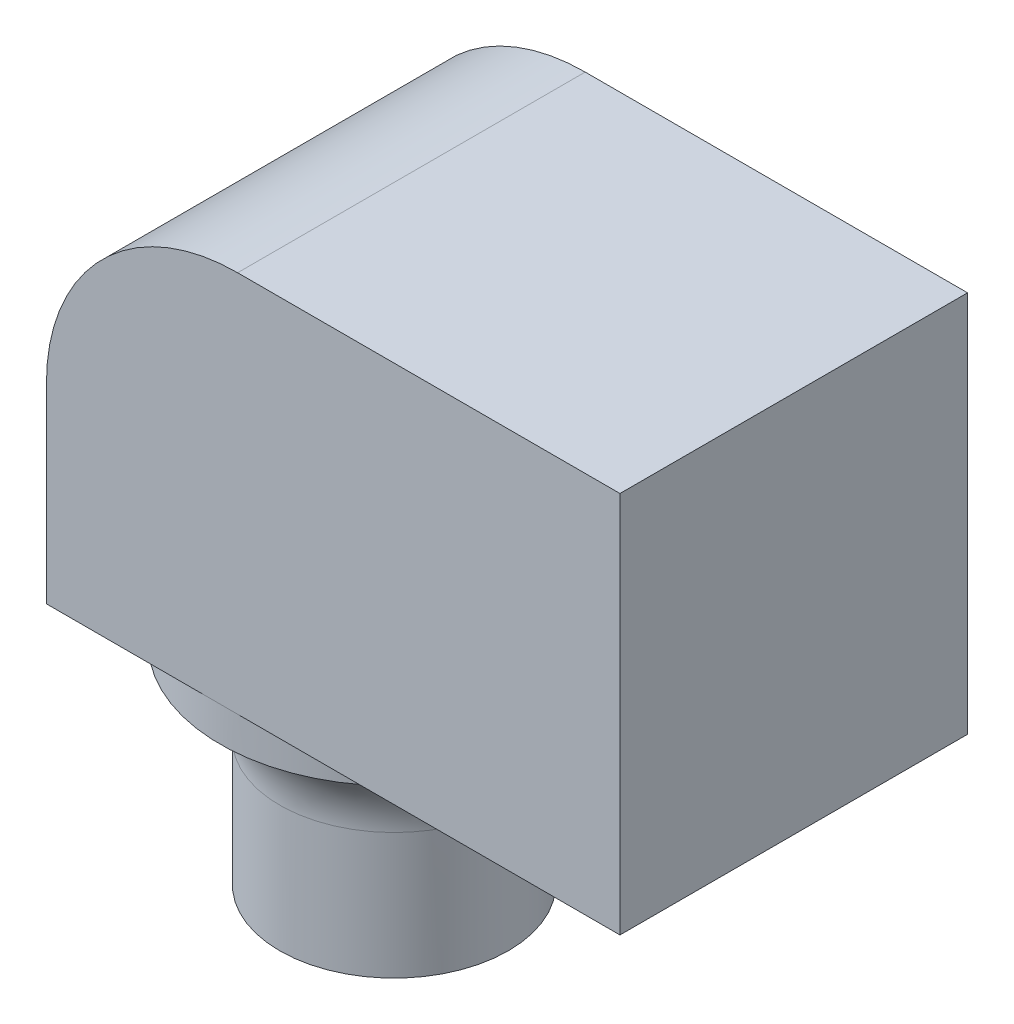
ISO-10303-21;
HEADER;
FILE_DESCRIPTION(('STEP AP214'),'2;1');
FILE_NAME('part.step','',(''),(''),'','','');
FILE_SCHEMA(('AUTOMOTIVE_DESIGN { 1 0 10303 214 1 1 1 1 }'));
ENDSEC;
DATA;
#1=APPLICATION_CONTEXT('core data for automotive mechanical design processes');
#2=APPLICATION_PROTOCOL_DEFINITION('international standard','automotive_design',2000,#1);
#3=PRODUCT_CONTEXT('',#1,'mechanical');
#4=PRODUCT('Part','Part','',(#3));
#5=PRODUCT_RELATED_PRODUCT_CATEGORY('part','',(#4));
#6=PRODUCT_DEFINITION_FORMATION('','',#4);
#7=PRODUCT_DEFINITION_CONTEXT('part definition',#1,'design');
#8=PRODUCT_DEFINITION('design','',#6,#7);
#9=PRODUCT_DEFINITION_SHAPE('','',#8);
#10=(LENGTH_UNIT() NAMED_UNIT(*) SI_UNIT(.MILLI.,.METRE.));
#11=(NAMED_UNIT(*) PLANE_ANGLE_UNIT() SI_UNIT($,.RADIAN.));
#12=(NAMED_UNIT(*) SI_UNIT($,.STERADIAN.) SOLID_ANGLE_UNIT());
#13=UNCERTAINTY_MEASURE_WITH_UNIT(LENGTH_MEASURE(1.E-05),#10,'distance_accuracy_value','');
#14=(GEOMETRIC_REPRESENTATION_CONTEXT(3) GLOBAL_UNCERTAINTY_ASSIGNED_CONTEXT((#13)) GLOBAL_UNIT_ASSIGNED_CONTEXT((#10,
#11,#12)) REPRESENTATION_CONTEXT('',''));
#15=CARTESIAN_POINT('',(0.,0.,0.));
#16=DIRECTION('',(0.,0.,1.));
#17=DIRECTION('',(1.,0.,0.));
#18=AXIS2_PLACEMENT_3D('',#15,#16,#17);
#19=CARTESIAN_POINT('',(16.5,-11.,20.));
#20=DIRECTION('',(0.,1.,0.));
#21=DIRECTION('',(-1.,0.,0.));
#22=AXIS2_PLACEMENT_3D('',#19,#20,#21);
#23=PLANE('',#22);
#24=CARTESIAN_POINT('',(-6.5,-11.,10.));
#25=DIRECTION('',(0.,-1.,0.));
#26=DIRECTION('',(1.,0.,0.));
#27=AXIS2_PLACEMENT_3D('',#24,#25,#26);
#28=CIRCLE('',#27,10.);
#29=CARTESIAN_POINT('',(-6.5,-11.,20.));
#30=VERTEX_POINT('',#29);
#31=CARTESIAN_POINT('',(-16.5,-11.,10.));
#32=VERTEX_POINT('',#31);
#33=EDGE_CURVE('E89',#30,#32,#28,.T.);
#34=ORIENTED_EDGE('',*,*,#33,.F.);
#35=DIRECTION('',(1.,0.,0.));
#36=VECTOR('',#35,1.);
#37=CARTESIAN_POINT('',(16.5,-11.,20.));
#38=LINE('',#37,#36);
#39=CARTESIAN_POINT('',(-16.5,-11.,20.));
#40=VERTEX_POINT('',#39);
#41=EDGE_CURVE('E71',#40,#30,#38,.T.);
#42=ORIENTED_EDGE('',*,*,#41,.F.);
#43=DIRECTION('',(0.,0.,-1.));
#44=VECTOR('',#43,1.);
#45=CARTESIAN_POINT('',(-16.5,-11.,20.));
#46=LINE('',#45,#44);
#47=EDGE_CURVE('E90',#40,#32,#46,.T.);
#48=ORIENTED_EDGE('',*,*,#47,.T.);
#49=EDGE_LOOP('',(#34,#42,#48));
#50=FACE_BOUND('',#49,.T.);
#51=ADVANCED_FACE('F15',(#50),#23,.F.);
#52=CARTESIAN_POINT('',(-6.5,-11.,0.));
#53=VERTEX_POINT('',#52);
#54=EDGE_CURVE('E23',#32,#53,#28,.T.);
#55=ORIENTED_EDGE('',*,*,#54,.F.);
#56=CARTESIAN_POINT('',(-16.5,-11.,0.));
#57=VERTEX_POINT('',#56);
#58=EDGE_CURVE('E120',#32,#57,#46,.T.);
#59=ORIENTED_EDGE('',*,*,#58,.T.);
#60=DIRECTION('',(1.,0.,0.));
#61=VECTOR('',#60,1.);
#62=CARTESIAN_POINT('',(16.5,-11.,0.));
#63=LINE('',#62,#61);
#64=EDGE_CURVE('E111',#57,#53,#63,.T.);
#65=ORIENTED_EDGE('',*,*,#64,.T.);
#66=EDGE_LOOP('',(#55,#59,#65));
#67=FACE_BOUND('',#66,.T.);
#68=ADVANCED_FACE('F144',(#67),#23,.F.);
#69=CARTESIAN_POINT('',(-16.5,-11.,20.));
#70=DIRECTION('',(1.,0.,0.));
#71=DIRECTION('',(0.,0.,-1.));
#72=AXIS2_PLACEMENT_3D('',#69,#70,#71);
#73=PLANE('',#72);
#74=DIRECTION('',(0.,-1.,0.));
#75=VECTOR('',#74,1.);
#76=CARTESIAN_POINT('',(-16.5,-11.,20.));
#77=LINE('',#76,#75);
#78=CARTESIAN_POINT('',(-16.5,0.,20.));
#79=VERTEX_POINT('',#78);
#80=EDGE_CURVE('E77',#79,#40,#77,.T.);
#81=ORIENTED_EDGE('',*,*,#80,.F.);
#82=DIRECTION('',(0.,0.,-1.));
#83=VECTOR('',#82,1.);
#84=CARTESIAN_POINT('',(-16.5,0.,20.));
#85=LINE('',#84,#83);
#86=CARTESIAN_POINT('',(-16.5,0.,0.));
#87=VERTEX_POINT('',#86);
#88=EDGE_CURVE('E122',#79,#87,#85,.T.);
#89=ORIENTED_EDGE('',*,*,#88,.T.);
#90=DIRECTION('',(0.,-1.,0.));
#91=VECTOR('',#90,1.);
#92=CARTESIAN_POINT('',(-16.5,-11.,0.));
#93=LINE('',#92,#91);
#94=EDGE_CURVE('E107',#87,#57,#93,.T.);
#95=ORIENTED_EDGE('',*,*,#94,.T.);
#96=ORIENTED_EDGE('',*,*,#58,.F.);
#97=ORIENTED_EDGE('',*,*,#47,.F.);
#98=EDGE_LOOP('',(#81,#89,#95,#96,#97));
#99=FACE_BOUND('',#98,.T.);
#100=ADVANCED_FACE('F139',(#99),#73,.F.);
#101=EDGE_CURVE('E37',#53,#30,#28,.T.);
#102=ORIENTED_EDGE('',*,*,#101,.F.);
#103=CARTESIAN_POINT('',(16.5,-11.,0.));
#104=VERTEX_POINT('',#103);
#105=EDGE_CURVE('E110',#53,#104,#63,.T.);
#106=ORIENTED_EDGE('',*,*,#105,.T.);
#107=DIRECTION('',(0.,0.,-1.));
#108=VECTOR('',#107,1.);
#109=CARTESIAN_POINT('',(16.5,-11.,20.));
#110=LINE('',#109,#108);
#111=CARTESIAN_POINT('',(16.5,-11.,20.));
#112=VERTEX_POINT('',#111);
#113=EDGE_CURVE('E86',#112,#104,#110,.T.);
#114=ORIENTED_EDGE('',*,*,#113,.F.);
#115=EDGE_CURVE('E74',#30,#112,#38,.T.);
#116=ORIENTED_EDGE('',*,*,#115,.F.);
#117=EDGE_LOOP('',(#102,#106,#114,#116));
#118=FACE_BOUND('',#117,.T.);
#119=ADVANCED_FACE('F84',(#118),#23,.F.);
#120=CARTESIAN_POINT('',(16.5,-11.,20.));
#121=DIRECTION('',(-1.,0.,0.));
#122=DIRECTION('',(0.,0.,1.));
#123=AXIS2_PLACEMENT_3D('',#120,#121,#122);
#124=PLANE('',#123);
#125=DIRECTION('',(0.,1.,0.));
#126=VECTOR('',#125,1.);
#127=CARTESIAN_POINT('',(16.5,-11.,0.));
#128=LINE('',#127,#126);
#129=CARTESIAN_POINT('',(16.5,11.,0.));
#130=VERTEX_POINT('',#129);
#131=EDGE_CURVE('E113',#104,#130,#128,.T.);
#132=ORIENTED_EDGE('',*,*,#131,.T.);
#133=DIRECTION('',(0.,0.,-1.));
#134=VECTOR('',#133,1.);
#135=CARTESIAN_POINT('',(16.5,11.,20.));
#136=LINE('',#135,#134);
#137=CARTESIAN_POINT('',(16.5,11.,20.));
#138=VERTEX_POINT('',#137);
#139=EDGE_CURVE('E106',#138,#130,#136,.T.);
#140=ORIENTED_EDGE('',*,*,#139,.F.);
#141=DIRECTION('',(0.,1.,0.));
#142=VECTOR('',#141,1.);
#143=CARTESIAN_POINT('',(16.5,-11.,20.));
#144=LINE('',#143,#142);
#145=EDGE_CURVE('E82',#112,#138,#144,.T.);
#146=ORIENTED_EDGE('',*,*,#145,.F.);
#147=ORIENTED_EDGE('',*,*,#113,.T.);
#148=EDGE_LOOP('',(#132,#140,#146,#147));
#149=FACE_BOUND('',#148,.T.);
#150=ADVANCED_FACE('F156',(#149),#124,.F.);
#151=CARTESIAN_POINT('',(16.5,11.,20.));
#152=DIRECTION('',(0.,-1.,0.));
#153=DIRECTION('',(1.,0.,0.));
#154=AXIS2_PLACEMENT_3D('',#151,#152,#153);
#155=PLANE('',#154);
#156=DIRECTION('',(-1.,0.,0.));
#157=VECTOR('',#156,1.);
#158=CARTESIAN_POINT('',(16.5,11.,0.));
#159=LINE('',#158,#157);
#160=CARTESIAN_POINT('',(-5.5,11.,0.));
#161=VERTEX_POINT('',#160);
#162=EDGE_CURVE('E101',#130,#161,#159,.T.);
#163=ORIENTED_EDGE('',*,*,#162,.T.);
#164=DIRECTION('',(0.,0.,-1.));
#165=VECTOR('',#164,1.);
#166=CARTESIAN_POINT('',(-5.5,11.,20.));
#167=LINE('',#166,#165);
#168=CARTESIAN_POINT('',(-5.5,11.,20.));
#169=VERTEX_POINT('',#168);
#170=EDGE_CURVE('E97',#161,#169,#167,.F.);
#171=ORIENTED_EDGE('',*,*,#170,.T.);
#172=DIRECTION('',(-1.,0.,0.));
#173=VECTOR('',#172,1.);
#174=CARTESIAN_POINT('',(16.5,11.,20.));
#175=LINE('',#174,#173);
#176=EDGE_CURVE('E104',#138,#169,#175,.T.);
#177=ORIENTED_EDGE('',*,*,#176,.F.);
#178=ORIENTED_EDGE('',*,*,#139,.T.);
#179=EDGE_LOOP('',(#163,#171,#177,#178));
#180=FACE_BOUND('',#179,.T.);
#181=ADVANCED_FACE('F130',(#180),#155,.F.);
#182=CARTESIAN_POINT('',(0.,0.,20.));
#183=DIRECTION('',(0.,0.,1.));
#184=DIRECTION('',(1.,0.,0.));
#185=AXIS2_PLACEMENT_3D('',#182,#183,#184);
#186=PLANE('',#185);
#187=ORIENTED_EDGE('',*,*,#176,.T.);
#188=CARTESIAN_POINT('',(-5.5,0.,20.));
#189=DIRECTION('',(0.,0.,1.));
#190=DIRECTION('',(1.,0.,0.));
#191=AXIS2_PLACEMENT_3D('',#188,#189,#190);
#192=CIRCLE('',#191,11.);
#193=EDGE_CURVE('E96',#169,#79,#192,.T.);
#194=ORIENTED_EDGE('',*,*,#193,.T.);
#195=ORIENTED_EDGE('',*,*,#80,.T.);
#196=ORIENTED_EDGE('',*,*,#41,.T.);
#197=ORIENTED_EDGE('',*,*,#115,.T.);
#198=ORIENTED_EDGE('',*,*,#145,.T.);
#199=EDGE_LOOP('',(#187,#194,#195,#196,#197,#198));
#200=FACE_BOUND('',#199,.T.);
#201=ADVANCED_FACE('F73',(#200),#186,.T.);
#202=CARTESIAN_POINT('',(0.,0.,0.));
#203=DIRECTION('',(0.,0.,1.));
#204=DIRECTION('',(1.,0.,0.));
#205=AXIS2_PLACEMENT_3D('',#202,#203,#204);
#206=PLANE('',#205);
#207=ORIENTED_EDGE('',*,*,#94,.F.);
#208=CARTESIAN_POINT('',(-5.5,0.,0.));
#209=DIRECTION('',(0.,0.,1.));
#210=DIRECTION('',(1.,0.,0.));
#211=AXIS2_PLACEMENT_3D('',#208,#209,#210);
#212=CIRCLE('',#211,11.);
#213=EDGE_CURVE('E125',#87,#161,#212,.F.);
#214=ORIENTED_EDGE('',*,*,#213,.T.);
#215=ORIENTED_EDGE('',*,*,#162,.F.);
#216=ORIENTED_EDGE('',*,*,#131,.F.);
#217=ORIENTED_EDGE('',*,*,#105,.F.);
#218=ORIENTED_EDGE('',*,*,#64,.F.);
#219=EDGE_LOOP('',(#207,#214,#215,#216,#217,#218));
#220=FACE_BOUND('',#219,.T.);
#221=ADVANCED_FACE('F142',(#220),#206,.F.);
#222=CARTESIAN_POINT('',(-5.5,0.,20.));
#223=DIRECTION('',(0.,0.,-1.));
#224=DIRECTION('',(-1.,0.,0.));
#225=AXIS2_PLACEMENT_3D('',#222,#223,#224);
#226=CYLINDRICAL_SURFACE('',#225,11.);
#227=ORIENTED_EDGE('',*,*,#193,.F.);
#228=ORIENTED_EDGE('',*,*,#170,.F.);
#229=ORIENTED_EDGE('',*,*,#213,.F.);
#230=ORIENTED_EDGE('',*,*,#88,.F.);
#231=EDGE_LOOP('',(#227,#228,#229,#230));
#232=FACE_BOUND('',#231,.T.);
#233=ADVANCED_FACE('F136',(#232),#226,.T.);
#234=CARTESIAN_POINT('',(-6.5,-13.,10.));
#235=DIRECTION('',(0.,1.,0.));
#236=DIRECTION('',(-1.,0.,0.));
#237=AXIS2_PLACEMENT_3D('',#234,#235,#236);
#238=CYLINDRICAL_SURFACE('',#237,10.);
#239=CARTESIAN_POINT('',(-6.5,-13.,10.));
#240=DIRECTION('',(0.,-1.,0.));
#241=DIRECTION('',(1.,0.,0.));
#242=AXIS2_PLACEMENT_3D('',#239,#240,#241);
#243=CIRCLE('',#242,10.);
#244=CARTESIAN_POINT('',(3.5,-13.,10.));
#245=VERTEX_POINT('',#244);
#246=EDGE_CURVE('E92',#245,#245,#243,.T.);
#247=ORIENTED_EDGE('',*,*,#246,.F.);
#248=EDGE_LOOP('',(#247));
#249=FACE_BOUND('',#248,.T.);
#250=ORIENTED_EDGE('',*,*,#33,.T.);
#251=ORIENTED_EDGE('',*,*,#54,.T.);
#252=ORIENTED_EDGE('',*,*,#101,.T.);
#253=EDGE_LOOP('',(#250,#251,#252));
#254=FACE_BOUND('',#253,.T.);
#255=ADVANCED_FACE('F95',(#249,#254),#238,.T.);
#256=CARTESIAN_POINT('',(-6.5,-25.,10.));
#257=DIRECTION('',(0.,1.,0.));
#258=DIRECTION('',(-1.,0.,0.));
#259=AXIS2_PLACEMENT_3D('',#256,#257,#258);
#260=CYLINDRICAL_SURFACE('',#259,6.5785);
#261=CARTESIAN_POINT('',(-6.5,-17.7442952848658,10.));
#262=DIRECTION('',(0.,1.,0.));
#263=DIRECTION('',(-1.,0.,0.));
#264=AXIS2_PLACEMENT_3D('',#261,#262,#263);
#265=CIRCLE('',#264,6.5785);
#266=CARTESIAN_POINT('',(-13.0785,-17.7442952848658,10.));
#267=VERTEX_POINT('',#266);
#268=EDGE_CURVE('E9',#267,#267,#265,.F.);
#269=ORIENTED_EDGE('',*,*,#268,.T.);
#270=EDGE_LOOP('',(#269));
#271=FACE_BOUND('',#270,.T.);
#272=CARTESIAN_POINT('',(-6.5,-25.,10.));
#273=DIRECTION('',(0.,-1.,0.));
#274=DIRECTION('',(1.,0.,0.));
#275=AXIS2_PLACEMENT_3D('',#272,#273,#274);
#276=CIRCLE('',#275,6.5785);
#277=CARTESIAN_POINT('',(0.0785000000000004,-25.,10.));
#278=VERTEX_POINT('',#277);
#279=EDGE_CURVE('E93',#278,#278,#276,.T.);
#280=ORIENTED_EDGE('',*,*,#279,.F.);
#281=EDGE_LOOP('',(#280));
#282=FACE_BOUND('',#281,.T.);
#283=ADVANCED_FACE('F174',(#271,#282),#260,.T.);
#284=CARTESIAN_POINT('',(-6.5,-25.,10.));
#285=DIRECTION('',(0.,-1.,0.));
#286=DIRECTION('',(1.,0.,0.));
#287=AXIS2_PLACEMENT_3D('',#284,#285,#286);
#288=PLANE('',#287);
#289=ORIENTED_EDGE('',*,*,#279,.T.);
#290=EDGE_LOOP('',(#289));
#291=FACE_BOUND('',#290,.T.);
#292=ADVANCED_FACE('F178',(#291),#288,.T.);
#293=CARTESIAN_POINT('',(-6.5,-17.7442952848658,10.));
#294=DIRECTION('',(0.,1.,0.));
#295=DIRECTION('',(-1.,0.,0.));
#296=AXIS2_PLACEMENT_3D('',#293,#294,#295);
#297=TOROIDAL_SURFACE('',#296,11.5785,5.);
#298=ORIENTED_EDGE('',*,*,#246,.T.);
#299=EDGE_LOOP('',(#298));
#300=FACE_BOUND('',#299,.T.);
#301=ORIENTED_EDGE('',*,*,#268,.F.);
#302=EDGE_LOOP('',(#301));
#303=FACE_BOUND('',#302,.T.);
#304=ADVANCED_FACE('F17',(#300,#303),#297,.F.);
#305=CLOSED_SHELL('',(#51,#68,#100,#119,#150,#181,#201,#221,#233,#255,#283,#292,#304));
#306=MANIFOLD_SOLID_BREP('B1',#305);
#307=ADVANCED_BREP_SHAPE_REPRESENTATION('',(#18,#306),#14);
#308=SHAPE_DEFINITION_REPRESENTATION(#9,#307);
ENDSEC;
END-ISO-10303-21;
